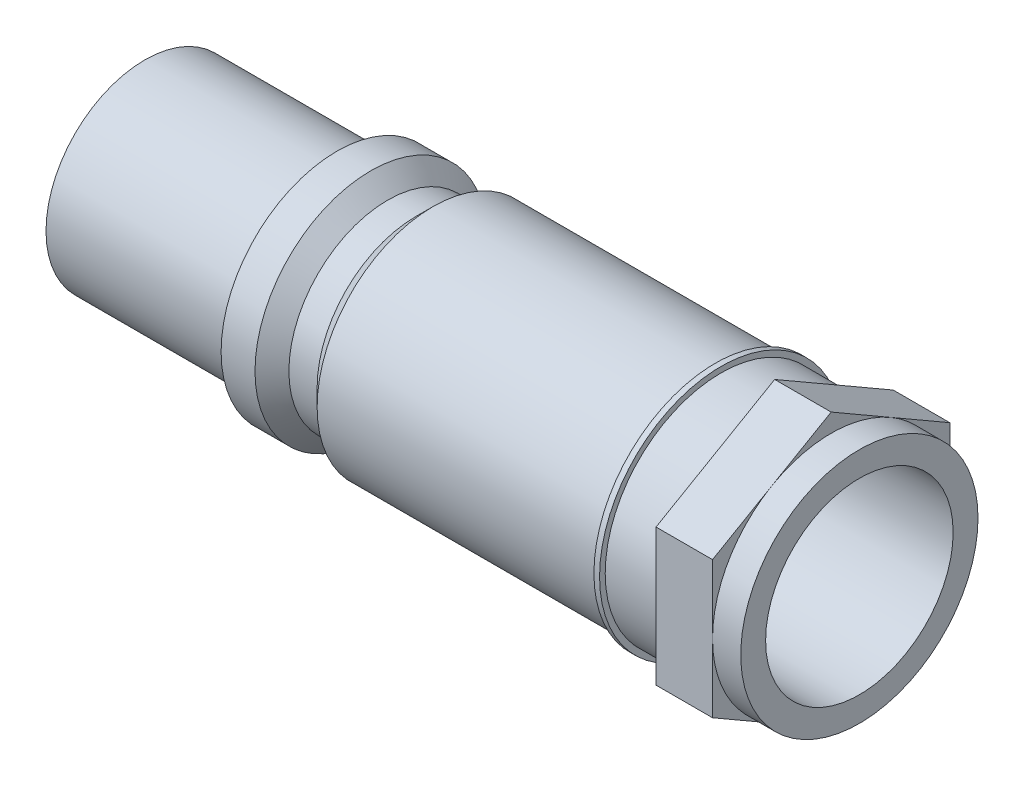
from build123d import *

# Parameters (mm, degrees)
SALIENTE_EXTRUIR2_DEPTH = 10
CROQUIS5_R              = 21
SALIENTE_EXTRUIR3_DEPTH = 5
CROQUIS6_R              = 16.6
CORTAR_EXTRUIR2_DEPTH   = 131.585221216


with BuildPart() as part:
    # Croquis1 → Revoluci_n1 (revolve)
    with BuildSketch(Plane.XY, mode=Mode.PRIVATE) as revoluci_n1_sk:
        Polygon((0, 0), (0, 17.5), (34, 17.5), (34, 20.5), (40, 20.5), (43, 17.5), (48, 17.5), (51, 20.5), (101, 20.5), (101, 21.5), (102, 21.5), (102, 20.5), (111.5, 20.5), (111.5, 0), align=None)
    revolve(revoluci_n1_sk.sketch.rotate(Axis((0, 0, 0), (1, 0, 0)), 90), axis=Axis((0, 0, 0), (1, 0, 0)))

    # Croquis4 → Saliente-Extruir2 (add)
    with BuildSketch(Plane(origin=(111.5, 0, 0), x_dir=(0, 0, -1), z_dir=(1, 0, 0))):
        Polygon((0, 24.248711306), (-21, 12.124355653), (-21, -12.124355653), (0, -24.248711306), (21, -12.124355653), (21, 12.124355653), align=None)
    extrude(amount=SALIENTE_EXTRUIR2_DEPTH)

    # Croquis5 → Saliente-Extruir3 (add)
    with BuildSketch(Plane(origin=(121.5, 0, 0), x_dir=(0, 0, -1), z_dir=(1, 0, 0))):
        Circle(CROQUIS5_R)
    extrude(amount=SALIENTE_EXTRUIR3_DEPTH)

    # Croquis6 → Cortar-Extruir2 (cut, through all)
    with BuildSketch(Plane(origin=(126.5, 0, 0), x_dir=(0, 0, -1), z_dir=(1, 0, 0))):
        Circle(CROQUIS6_R)
    extrude(amount=-CORTAR_EXTRUIR2_DEPTH, mode=Mode.SUBTRACT)


solid = part.part
